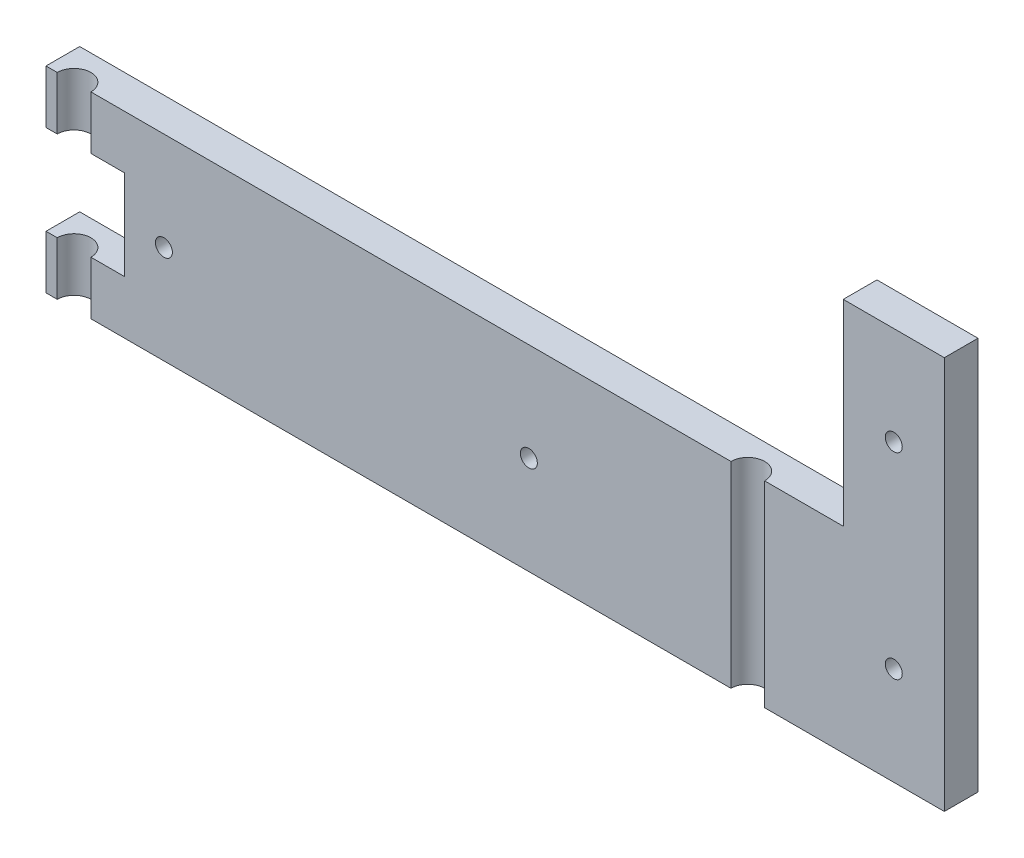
from build123d import *

# Parameters (mm, degrees)
ESQUISSE1_R             = 1.51
EXTRUSION1_DEPTH        = 6
ESQUISSE2_R             = 3
ENL_V_MAT_EXTRU_1_DEPTH = 171.179317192


with BuildPart() as part:
    # Esquisse1 → Extrusion1 (new body)
    with BuildSketch(Plane.XY):
        Polygon((155, 70), (137, 70), (137, 35), (-5, 35), (-5, 25.5), (9, 25.5), (9, 9.5), (-5, 9.5), (-5, 0), (155, 0), align=None)
        with Locations((146, 17.5)):
            Circle(ESQUISSE1_R, mode=Mode.SUBTRACT)
        with Locations((146, 52.5)):
            Circle(ESQUISSE1_R, mode=Mode.SUBTRACT)
        with Locations((81, 17.5)):
            Circle(ESQUISSE1_R, mode=Mode.SUBTRACT)
        with Locations((16, 17.5)):
            Circle(ESQUISSE1_R, mode=Mode.SUBTRACT)
    extrude(amount=EXTRUSION1_DEPTH)

    # Esquisse2 → Enl_v. mat.-Extru.1 (cut, through all)
    with BuildSketch(Plane.XZ):
        with Locations((0, 6)):
            Circle(ESQUISSE2_R)
        with Locations((120, 6)):
            Circle(ESQUISSE2_R)
    extrude(amount=-ENL_V_MAT_EXTRU_1_DEPTH, mode=Mode.SUBTRACT)


solid = part.part
